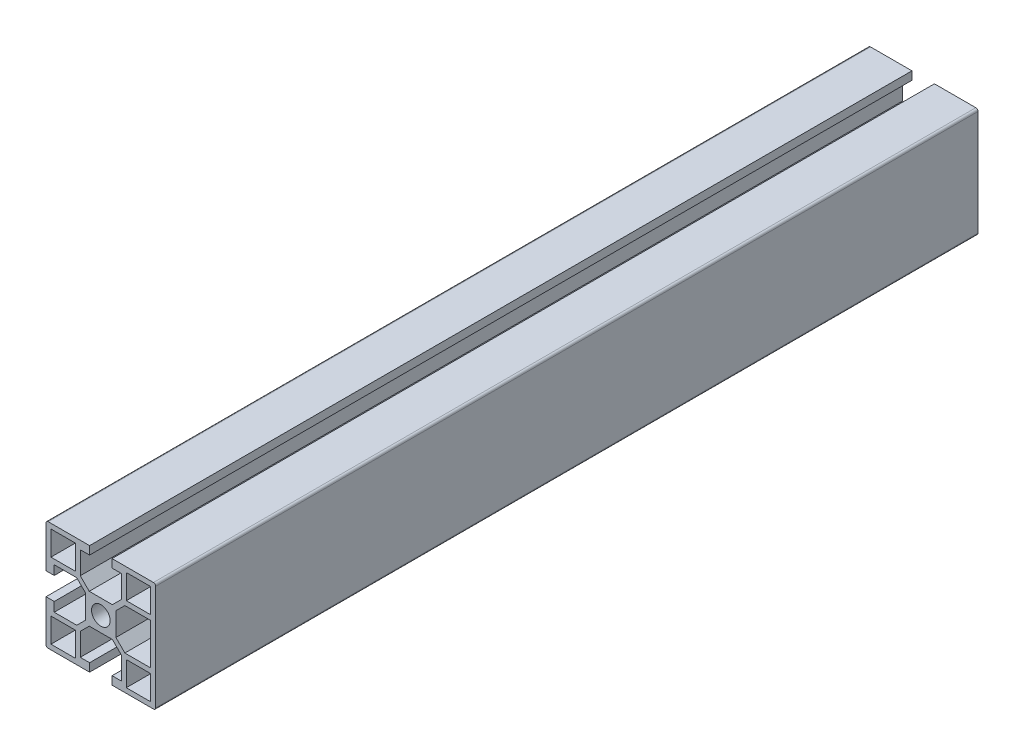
from build123d import *

# Parameters (mm, degrees)
MODEL_R         = 3.4
MODEL_W         = 8.9
MODEL_H         = 8.9
EXTRUDE_1_DEPTH = 300


with BuildPart() as part:
    # Model → Extrude 1 (new body)
    with BuildSketch(Plane.XY):
        with BuildLine():
            Line((7976.542230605, 2610.893564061), (7976.542230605, 2649.293564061))
            ThreePointArc((7976.542230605, 2649.293564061), (7976.30791603, 2649.859249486), (7975.742230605, 2650.093564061))
            Line((7975.742230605, 2650.093564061), (7960.642230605, 2650.093564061))
            Line((7960.642230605, 2650.093564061), (7960.642230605, 2647.093564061))
            Line((7960.642230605, 2647.093564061), (7964.042230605, 2647.093564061))
            Line((7964.042230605, 2647.093564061), (7964.042230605, 2638.866356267))
            Line((7964.042230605, 2638.866356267), (7960.769438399, 2635.593564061))
            Line((7960.769438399, 2635.593564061), (7952.315022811, 2635.593564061))
            Line((7952.315022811, 2635.593564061), (7949.042230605, 2638.866356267))
            Line((7949.042230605, 2638.866356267), (7949.042230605, 2647.093564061))
            Line((7949.042230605, 2647.093564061), (7952.442230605, 2647.093564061))
            Line((7952.442230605, 2647.093564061), (7952.442230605, 2650.093564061))
            Line((7952.442230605, 2650.093564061), (7937.342230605, 2650.093564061))
            ThreePointArc((7937.342230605, 2650.093564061), (7936.77654518, 2649.859249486), (7936.542230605, 2649.293564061))
            Line((7936.542230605, 2649.293564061), (7936.542230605, 2634.193564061))
            Line((7936.542230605, 2634.193564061), (7939.542230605, 2634.193564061))
            Line((7939.542230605, 2634.193564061), (7939.542230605, 2637.593564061))
            Line((7939.542230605, 2637.593564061), (7947.769438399, 2637.593564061))
            Line((7947.769438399, 2637.593564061), (7951.042230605, 2634.320771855))
            Line((7951.042230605, 2634.320771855), (7951.042230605, 2625.866356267))
            Line((7951.042230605, 2625.866356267), (7947.769438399, 2622.593564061))
            Line((7947.769438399, 2622.593564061), (7939.542230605, 2622.593564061))
            Line((7939.542230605, 2622.593564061), (7939.542230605, 2625.993564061))
            Line((7939.542230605, 2625.993564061), (7936.542230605, 2625.993564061))
            Line((7936.542230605, 2625.993564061), (7936.542230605, 2610.893564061))
            ThreePointArc((7936.542230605, 2610.893564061), (7936.77654518, 2610.327878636), (7937.342230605, 2610.093564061))
            Line((7937.342230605, 2610.093564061), (7952.442230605, 2610.093564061))
            Line((7952.442230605, 2610.093564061), (7952.442230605, 2613.093564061))
            Line((7952.442230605, 2613.093564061), (7949.042230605, 2613.093564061))
            Line((7949.042230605, 2613.093564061), (7949.042230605, 2621.320771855))
            Line((7949.042230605, 2621.320771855), (7952.315022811, 2624.593564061))
            Line((7952.315022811, 2624.593564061), (7960.769438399, 2624.593564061))
            Line((7960.769438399, 2624.593564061), (7964.042230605, 2621.320771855))
            Line((7964.042230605, 2621.320771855), (7964.042230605, 2613.093564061))
            Line((7964.042230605, 2613.093564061), (7960.642230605, 2613.093564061))
            Line((7960.642230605, 2613.093564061), (7960.642230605, 2610.093564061))
            Line((7960.642230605, 2610.093564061), (7975.742230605, 2610.093564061))
            ThreePointArc((7975.742230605, 2610.093564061), (7976.30791603, 2610.327878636), (7976.542230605, 2610.893564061))
        make_face()
        with Locations((7956.542230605, 2630.093564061)):
            Circle(MODEL_R, mode=Mode.SUBTRACT)
        Polygon((7974.742230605, 2622.593564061), (7974.742230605, 2637.593564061), (7965.315022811, 2637.593564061), (7962.042230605, 2634.320771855), (7962.042230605, 2625.866356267), (7965.315022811, 2622.593564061), align=None, mode=Mode.SUBTRACT)
        with Locations((7970.292230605, 2643.843564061)):
            Rectangle(MODEL_W, MODEL_H, mode=Mode.SUBTRACT)
        with Locations((7970.292230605, 2616.343564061)):
            Rectangle(MODEL_W, MODEL_H, mode=Mode.SUBTRACT)
        with Locations((7942.792230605, 2616.343564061)):
            Rectangle(MODEL_W, MODEL_H, mode=Mode.SUBTRACT)
        with Locations((7942.792230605, 2643.843564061)):
            Rectangle(MODEL_W, MODEL_H, mode=Mode.SUBTRACT)
    extrude(amount=EXTRUDE_1_DEPTH)


solid = part.part
